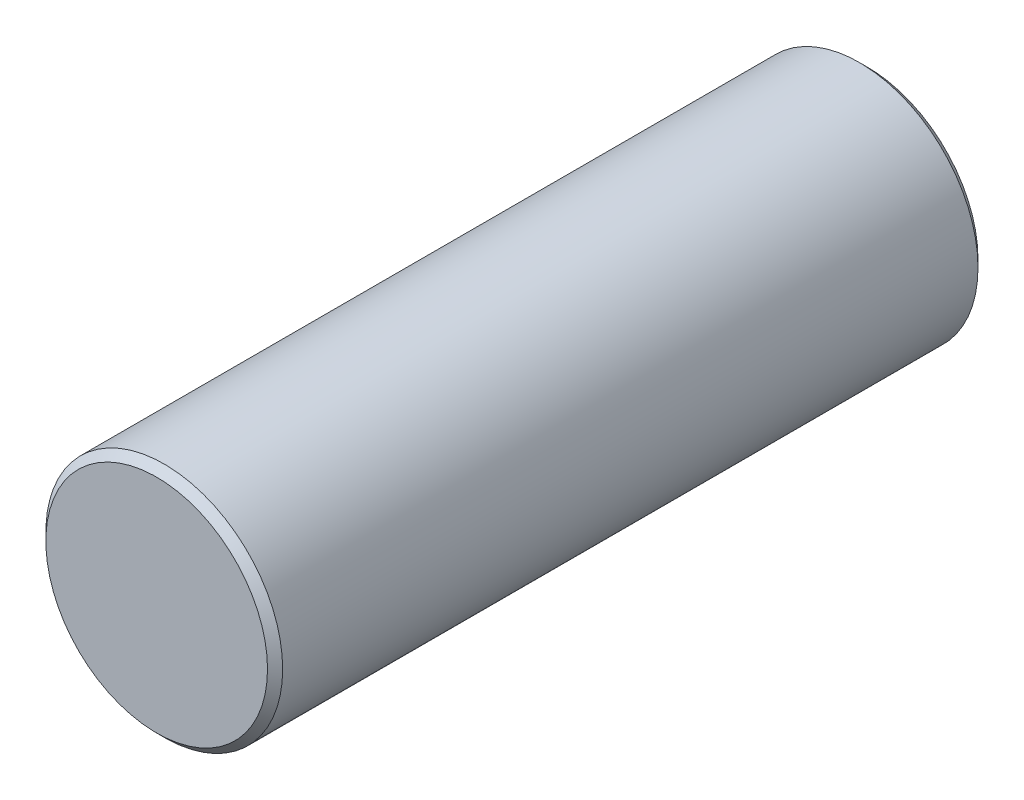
ISO-10303-21;
HEADER;
FILE_DESCRIPTION(('STEP AP214'),'2;1');
FILE_NAME('part.step','',(''),(''),'','','');
FILE_SCHEMA(('AUTOMOTIVE_DESIGN { 1 0 10303 214 1 1 1 1 }'));
ENDSEC;
DATA;
#1=APPLICATION_CONTEXT('core data for automotive mechanical design processes');
#2=APPLICATION_PROTOCOL_DEFINITION('international standard','automotive_design',2000,#1);
#3=PRODUCT_CONTEXT('',#1,'mechanical');
#4=PRODUCT('Part','Part','',(#3));
#5=PRODUCT_RELATED_PRODUCT_CATEGORY('part','',(#4));
#6=PRODUCT_DEFINITION_FORMATION('','',#4);
#7=PRODUCT_DEFINITION_CONTEXT('part definition',#1,'design');
#8=PRODUCT_DEFINITION('design','',#6,#7);
#9=PRODUCT_DEFINITION_SHAPE('','',#8);
#10=(LENGTH_UNIT() NAMED_UNIT(*) SI_UNIT(.MILLI.,.METRE.));
#11=(NAMED_UNIT(*) PLANE_ANGLE_UNIT() SI_UNIT($,.RADIAN.));
#12=(NAMED_UNIT(*) SI_UNIT($,.STERADIAN.) SOLID_ANGLE_UNIT());
#13=UNCERTAINTY_MEASURE_WITH_UNIT(LENGTH_MEASURE(1.E-05),#10,'distance_accuracy_value','');
#14=(GEOMETRIC_REPRESENTATION_CONTEXT(3) GLOBAL_UNCERTAINTY_ASSIGNED_CONTEXT((#13)) GLOBAL_UNIT_ASSIGNED_CONTEXT((#10,
#11,#12)) REPRESENTATION_CONTEXT('',''));
#15=CARTESIAN_POINT('',(0.,0.,0.));
#16=DIRECTION('',(0.,0.,1.));
#17=DIRECTION('',(1.,0.,0.));
#18=AXIS2_PLACEMENT_3D('',#15,#16,#17);
#19=CARTESIAN_POINT('',(0.,0.,19.05));
#20=DIRECTION('',(0.,0.,-1.));
#21=DIRECTION('',(-1.,0.,0.));
#22=AXIS2_PLACEMENT_3D('',#19,#20,#21);
#23=CYLINDRICAL_SURFACE('',#22,6.35);
#24=CARTESIAN_POINT('',(0.,0.,-18.6436));
#25=DIRECTION('',(0.,0.,1.));
#26=DIRECTION('',(1.,0.,0.));
#27=AXIS2_PLACEMENT_3D('',#24,#25,#26);
#28=CIRCLE('',#27,6.35);
#29=CARTESIAN_POINT('',(6.35,0.,-18.6436));
#30=VERTEX_POINT('',#29);
#31=EDGE_CURVE('E81',#30,#30,#28,.T.);
#32=ORIENTED_EDGE('',*,*,#31,.T.);
#33=EDGE_LOOP('',(#32));
#34=FACE_BOUND('',#33,.T.);
#35=CARTESIAN_POINT('',(0.,0.,18.6436));
#36=DIRECTION('',(0.,0.,1.));
#37=DIRECTION('',(1.,0.,0.));
#38=AXIS2_PLACEMENT_3D('',#35,#36,#37);
#39=CIRCLE('',#38,6.35);
#40=CARTESIAN_POINT('',(6.35,0.,18.6436));
#41=VERTEX_POINT('',#40);
#42=EDGE_CURVE('E85',#41,#41,#39,.F.);
#43=ORIENTED_EDGE('',*,*,#42,.T.);
#44=EDGE_LOOP('',(#43));
#45=FACE_BOUND('',#44,.T.);
#46=CARTESIAN_POINT('',(0.,-6.35,10.715625));
#47=CARTESIAN_POINT('',(0.108647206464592,-6.34999945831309,10.7156257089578));
#48=CARTESIAN_POINT('',(0.217301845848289,-6.34718528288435,10.7245772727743));
#49=CARTESIAN_POINT('',(0.431433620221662,-6.3362346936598,10.7600531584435));
#50=CARTESIAN_POINT('',(0.536910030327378,-6.32809707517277,10.7865814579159));
#51=CARTESIAN_POINT('',(0.741566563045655,-6.30738857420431,10.8562288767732));
#52=CARTESIAN_POINT('',(0.840756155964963,-6.29482455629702,10.8993223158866));
#53=CARTESIAN_POINT('',(1.030501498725,-6.26656051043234,11.0007674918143));
#54=CARTESIAN_POINT('',(1.12105588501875,-6.25085998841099,11.0591216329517));
#55=CARTESIAN_POINT('',(1.29375746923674,-6.21744714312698,11.1913288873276));
#56=CARTESIAN_POINT('',(1.3756005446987,-6.19969099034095,11.2655681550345));
#57=CARTESIAN_POINT('',(1.52590084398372,-6.16442198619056,11.4266160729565));
#58=CARTESIAN_POINT('',(1.59435557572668,-6.14690918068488,11.5134270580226));
#59=CARTESIAN_POINT('',(1.71758509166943,-6.11363942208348,11.6997869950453));
#60=CARTESIAN_POINT('',(1.77197994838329,-6.09793656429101,11.7995977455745));
#61=CARTESIAN_POINT('',(1.86308588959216,-6.07072385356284,12.0075203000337));
#62=CARTESIAN_POINT('',(1.89980163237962,-6.05921289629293,12.1156299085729));
#63=CARTESIAN_POINT('',(1.95339430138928,-6.04214576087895,12.3336495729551));
#64=CARTESIAN_POINT('',(1.97083537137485,-6.03642069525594,12.4434073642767));
#65=CARTESIAN_POINT('',(1.98714606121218,-6.03107212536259,12.6644290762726));
#66=CARTESIAN_POINT('',(1.98602061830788,-6.03144699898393,12.7756925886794));
#67=CARTESIAN_POINT('',(1.96567146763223,-6.03810687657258,12.991900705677));
#68=CARTESIAN_POINT('',(1.94716491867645,-6.04415767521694,13.0969212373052));
#69=CARTESIAN_POINT('',(1.89374166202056,-6.06110715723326,13.302285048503));
#70=CARTESIAN_POINT('',(1.85882321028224,-6.07200635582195,13.4026278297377));
#71=CARTESIAN_POINT('',(1.77306088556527,-6.09760407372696,13.5974962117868));
#72=CARTESIAN_POINT('',(1.72199181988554,-6.11235576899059,13.6919154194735));
#73=CARTESIAN_POINT('',(1.60553432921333,-6.14397197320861,13.8710793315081));
#74=CARTESIAN_POINT('',(1.54014218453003,-6.1608370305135,13.9558215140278));
#75=CARTESIAN_POINT('',(1.39337566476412,-6.19571925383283,14.1172802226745));
#76=CARTESIAN_POINT('',(1.31140925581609,-6.21375391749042,14.1934557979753));
#77=CARTESIAN_POINT('',(1.13564099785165,-6.24826618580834,14.3311116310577));
#78=CARTESIAN_POINT('',(1.04183827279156,-6.26474367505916,14.3925908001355));
#79=CARTESIAN_POINT('',(0.844017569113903,-6.29445805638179,14.4994752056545));
#80=CARTESIAN_POINT('',(0.73992566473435,-6.3076686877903,14.5447514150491));
#81=CARTESIAN_POINT('',(0.525094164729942,-6.32917129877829,14.6169903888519));
#82=CARTESIAN_POINT('',(0.41435659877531,-6.33746477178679,14.6439587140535));
#83=CARTESIAN_POINT('',(0.193968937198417,-6.34795830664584,14.6778948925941));
#84=CARTESIAN_POINT('',(0.0844420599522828,-6.35038136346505,14.6855950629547));
#85=CARTESIAN_POINT('',(-0.134350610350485,-6.34952057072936,14.6828411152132));
#86=CARTESIAN_POINT('',(-0.243616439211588,-6.34623755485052,14.6723896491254));
#87=CARTESIAN_POINT('',(-0.455960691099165,-6.33448002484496,14.6342169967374));
#88=CARTESIAN_POINT('',(-0.559125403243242,-6.32613659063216,14.6069315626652));
#89=CARTESIAN_POINT('',(-0.759383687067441,-6.30523442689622,14.5363972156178));
#90=CARTESIAN_POINT('',(-0.856476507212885,-6.29267517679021,14.4931463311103));
#91=CARTESIAN_POINT('',(-1.0444676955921,-6.26425186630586,14.390730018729));
#92=CARTESIAN_POINT('',(-1.13515733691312,-6.24831470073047,14.3312023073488));
#93=CARTESIAN_POINT('',(-1.30550578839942,-6.21495788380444,14.1983567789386));
#94=CARTESIAN_POINT('',(-1.38516159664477,-6.19753783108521,14.1250352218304));
#95=CARTESIAN_POINT('',(-1.53445759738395,-6.16230979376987,13.9632390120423));
#96=CARTESIAN_POINT('',(-1.60357585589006,-6.14451378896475,13.874279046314));
#97=CARTESIAN_POINT('',(-1.72594984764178,-6.11127091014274,13.6856364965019));
#98=CARTESIAN_POINT('',(-1.7792058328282,-6.09582399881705,13.5859540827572));
#99=CARTESIAN_POINT('',(-1.86801257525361,-6.06919954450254,13.3789020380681));
#100=CARTESIAN_POINT('',(-1.9036318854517,-6.05800551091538,13.2715640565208));
#101=CARTESIAN_POINT('',(-1.95616344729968,-6.04124983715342,13.0519924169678));
#102=CARTESIAN_POINT('',(-1.97308281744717,-6.03568605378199,12.9397606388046));
#103=CARTESIAN_POINT('',(-1.98722307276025,-6.03104414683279,12.7190435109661));
#104=CARTESIAN_POINT('',(-1.98530018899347,-6.03168409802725,12.6106182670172));
#105=CARTESIAN_POINT('',(-1.96387748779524,-6.03869268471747,12.3957165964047));
#106=CARTESIAN_POINT('',(-1.94437849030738,-6.04506105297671,12.2892400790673));
#107=CARTESIAN_POINT('',(-1.88893021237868,-6.06261192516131,12.0827894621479));
#108=CARTESIAN_POINT('',(-1.85322594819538,-6.07372258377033,11.9827429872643));
#109=CARTESIAN_POINT('',(-1.76657360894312,-6.0994878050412,11.7899808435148));
#110=CARTESIAN_POINT('',(-1.71562243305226,-6.11414308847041,11.6972666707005));
#111=CARTESIAN_POINT('',(-1.59759134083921,-6.14606160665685,11.5178745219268));
#112=CARTESIAN_POINT('',(-1.5299584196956,-6.16340443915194,11.4315745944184));
#113=CARTESIAN_POINT('',(-1.38145678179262,-6.19837785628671,11.2712717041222));
#114=CARTESIAN_POINT('',(-1.30058452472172,-6.21600851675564,11.1972720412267));
#115=CARTESIAN_POINT('',(-1.12472257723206,-6.25026169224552,11.0612514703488));
#116=CARTESIAN_POINT('',(-1.02935813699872,-6.26683248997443,10.9997006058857));
#117=CARTESIAN_POINT('',(-0.829118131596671,-6.29644996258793,10.8935854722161));
#118=CARTESIAN_POINT('',(-0.724246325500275,-6.30949802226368,10.8490145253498));
#119=CARTESIAN_POINT('',(-0.517124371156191,-6.32969033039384,10.7813612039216));
#120=CARTESIAN_POINT('',(-0.415401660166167,-6.3372403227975,10.7567811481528));
#121=CARTESIAN_POINT('',(-0.209121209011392,-6.34739491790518,10.7239143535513));
#122=CARTESIAN_POINT('',(-0.104564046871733,-6.35000052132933,10.7156243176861));
#123=CARTESIAN_POINT('',(0.,-6.35,10.715625));
#124=B_SPLINE_CURVE_WITH_KNOTS('',3,(#46,#47,#48,#49,#50,#51,#52,#53,#54,#55,#56,#57,#58,#59,
#60,#61,#62,#63,#64,#65,#66,#67,#68,#69,#70,#71,#72,#73,#74,#75,#76,#77,#78,#79,#80,#81,#82,#83,
#84,#85,#86,#87,#88,#89,#90,#91,#92,#93,#94,#95,#96,#97,#98,#99,#100,#101,#102,#103,#104,#105,
#106,#107,#108,#109,#110,#111,#112,#113,#114,#115,#116,#117,#118,#119,#120,#121,#122,#123),
.UNSPECIFIED.,.T.,.F.,(4,2,2,2,2,2,2,2,2,2,2,2,2,2,2,2,2,2,2,2,2,2,2,2,2,2,2,2,2,2,2,2,2,2,2,2,
2,2,4),(0.,0.325557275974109,0.651188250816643,0.976316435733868,1.30149587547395,
1.63572542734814,1.97001713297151,2.31257111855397,2.65503479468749,2.98718525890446,
3.31924739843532,3.63818356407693,3.95715362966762,4.28078332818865,4.60449717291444,
4.94294711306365,5.28142211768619,5.6225354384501,5.96354510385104,6.29138265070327,
6.61917230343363,6.93881369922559,7.25849457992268,7.5859691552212,7.91353265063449,
8.2540757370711,8.59461341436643,8.93381683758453,9.27289109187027,9.59663123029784,
9.92035626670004,10.2393418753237,10.5583924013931,10.8899247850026,11.2215459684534,
11.5639956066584,11.9063104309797,12.2196961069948,12.533018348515),.UNSPECIFIED.);
#125=CARTESIAN_POINT('',(0.,-6.35,10.715625));
#126=VERTEX_POINT('',#125);
#127=EDGE_CURVE('E35',#126,#126,#124,.T.);
#128=ORIENTED_EDGE('',*,*,#127,.F.);
#129=EDGE_LOOP('',(#128));
#130=FACE_BOUND('',#129,.T.);
#131=CARTESIAN_POINT('',(0.,-6.35,-14.684375));
#132=CARTESIAN_POINT('',(0.108647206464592,-6.34999945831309,-14.6843742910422));
#133=CARTESIAN_POINT('',(0.217301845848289,-6.34718528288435,-14.6754227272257));
#134=CARTESIAN_POINT('',(0.431433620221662,-6.3362346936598,-14.6399468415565));
#135=CARTESIAN_POINT('',(0.536910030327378,-6.32809707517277,-14.6134185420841));
#136=CARTESIAN_POINT('',(0.741566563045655,-6.30738857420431,-14.5437711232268));
#137=CARTESIAN_POINT('',(0.840756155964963,-6.29482455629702,-14.5006776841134));
#138=CARTESIAN_POINT('',(1.030501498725,-6.26656051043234,-14.3992325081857));
#139=CARTESIAN_POINT('',(1.12105588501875,-6.25085998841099,-14.3408783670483));
#140=CARTESIAN_POINT('',(1.29375746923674,-6.21744714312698,-14.2086711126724));
#141=CARTESIAN_POINT('',(1.3756005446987,-6.19969099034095,-14.1344318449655));
#142=CARTESIAN_POINT('',(1.52590084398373,-6.16442198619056,-13.9733839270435));
#143=CARTESIAN_POINT('',(1.59435557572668,-6.14690918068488,-13.8865729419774));
#144=CARTESIAN_POINT('',(1.71758509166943,-6.11363942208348,-13.7002130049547));
#145=CARTESIAN_POINT('',(1.77197994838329,-6.09793656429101,-13.6004022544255));
#146=CARTESIAN_POINT('',(1.86308588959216,-6.07072385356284,-13.3924796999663));
#147=CARTESIAN_POINT('',(1.89980163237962,-6.05921289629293,-13.2843700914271));
#148=CARTESIAN_POINT('',(1.95339430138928,-6.04214576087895,-13.0663504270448));
#149=CARTESIAN_POINT('',(1.97083537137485,-6.03642069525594,-12.9565926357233));
#150=CARTESIAN_POINT('',(1.98714606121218,-6.03107212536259,-12.7355709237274));
#151=CARTESIAN_POINT('',(1.98602061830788,-6.03144699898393,-12.6243074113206));
#152=CARTESIAN_POINT('',(1.96567146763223,-6.03810687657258,-12.408099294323));
#153=CARTESIAN_POINT('',(1.94716491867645,-6.04415767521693,-12.3030787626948));
#154=CARTESIAN_POINT('',(1.89374166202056,-6.06110715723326,-12.097714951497));
#155=CARTESIAN_POINT('',(1.85882321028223,-6.07200635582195,-11.9973721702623));
#156=CARTESIAN_POINT('',(1.77306088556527,-6.09760407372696,-11.8025037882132));
#157=CARTESIAN_POINT('',(1.72199181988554,-6.11235576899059,-11.7080845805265));
#158=CARTESIAN_POINT('',(1.60553432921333,-6.14397197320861,-11.5289206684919));
#159=CARTESIAN_POINT('',(1.54014218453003,-6.1608370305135,-11.4441784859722));
#160=CARTESIAN_POINT('',(1.39337566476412,-6.19571925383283,-11.2827197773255));
#161=CARTESIAN_POINT('',(1.31140925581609,-6.21375391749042,-11.2065442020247));
#162=CARTESIAN_POINT('',(1.13564099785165,-6.24826618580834,-11.0688883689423));
#163=CARTESIAN_POINT('',(1.04183827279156,-6.26474367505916,-11.0074091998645));
#164=CARTESIAN_POINT('',(0.844017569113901,-6.29445805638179,-10.9005247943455));
#165=CARTESIAN_POINT('',(0.739925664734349,-6.3076686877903,-10.8552485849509));
#166=CARTESIAN_POINT('',(0.525094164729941,-6.3291712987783,-10.7830096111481));
#167=CARTESIAN_POINT('',(0.414356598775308,-6.33746477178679,-10.7560412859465));
#168=CARTESIAN_POINT('',(0.193968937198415,-6.34795830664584,-10.7221051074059));
#169=CARTESIAN_POINT('',(0.0844420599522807,-6.35038136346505,-10.7144049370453));
#170=CARTESIAN_POINT('',(-0.134350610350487,-6.34952057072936,-10.7171588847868));
#171=CARTESIAN_POINT('',(-0.24361643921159,-6.34623755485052,-10.7276103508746));
#172=CARTESIAN_POINT('',(-0.455960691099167,-6.33448002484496,-10.7657830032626));
#173=CARTESIAN_POINT('',(-0.559125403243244,-6.32613659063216,-10.7930684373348));
#174=CARTESIAN_POINT('',(-0.759383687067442,-6.30523442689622,-10.8636027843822));
#175=CARTESIAN_POINT('',(-0.856476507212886,-6.29267517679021,-10.9068536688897));
#176=CARTESIAN_POINT('',(-1.0444676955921,-6.26425186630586,-11.009269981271));
#177=CARTESIAN_POINT('',(-1.13515733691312,-6.24831470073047,-11.0687976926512));
#178=CARTESIAN_POINT('',(-1.30550578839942,-6.21495788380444,-11.2016432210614));
#179=CARTESIAN_POINT('',(-1.38516159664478,-6.19753783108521,-11.2749647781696));
#180=CARTESIAN_POINT('',(-1.53445759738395,-6.16230979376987,-11.4367609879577));
#181=CARTESIAN_POINT('',(-1.60357585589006,-6.14451378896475,-11.525720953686));
#182=CARTESIAN_POINT('',(-1.72594984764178,-6.11127091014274,-11.7143635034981));
#183=CARTESIAN_POINT('',(-1.7792058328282,-6.09582399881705,-11.8140459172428));
#184=CARTESIAN_POINT('',(-1.86801257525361,-6.06919954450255,-12.0210979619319));
#185=CARTESIAN_POINT('',(-1.9036318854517,-6.05800551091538,-12.1284359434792));
#186=CARTESIAN_POINT('',(-1.95616344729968,-6.04124983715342,-12.3480075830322));
#187=CARTESIAN_POINT('',(-1.97308281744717,-6.03568605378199,-12.4602393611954));
#188=CARTESIAN_POINT('',(-1.98722307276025,-6.03104414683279,-12.6809564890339));
#189=CARTESIAN_POINT('',(-1.98530018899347,-6.03168409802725,-12.7893817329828));
#190=CARTESIAN_POINT('',(-1.96387748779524,-6.03869268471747,-13.0042834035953));
#191=CARTESIAN_POINT('',(-1.94437849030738,-6.04506105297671,-13.1107599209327));
#192=CARTESIAN_POINT('',(-1.88893021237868,-6.06261192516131,-13.3172105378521));
#193=CARTESIAN_POINT('',(-1.85322594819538,-6.07372258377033,-13.4172570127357));
#194=CARTESIAN_POINT('',(-1.76657360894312,-6.0994878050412,-13.6100191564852));
#195=CARTESIAN_POINT('',(-1.71562243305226,-6.11414308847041,-13.7027333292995));
#196=CARTESIAN_POINT('',(-1.59759134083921,-6.14606160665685,-13.8821254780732));
#197=CARTESIAN_POINT('',(-1.5299584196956,-6.16340443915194,-13.9684254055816));
#198=CARTESIAN_POINT('',(-1.38145678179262,-6.19837785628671,-14.1287282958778));
#199=CARTESIAN_POINT('',(-1.30058452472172,-6.21600851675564,-14.2027279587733));
#200=CARTESIAN_POINT('',(-1.12472257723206,-6.25026169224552,-14.3387485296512));
#201=CARTESIAN_POINT('',(-1.02935813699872,-6.26683248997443,-14.4002993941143));
#202=CARTESIAN_POINT('',(-0.82911813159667,-6.29644996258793,-14.5064145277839));
#203=CARTESIAN_POINT('',(-0.724246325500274,-6.30949802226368,-14.5509854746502));
#204=CARTESIAN_POINT('',(-0.51712437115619,-6.32969033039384,-14.6186387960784));
#205=CARTESIAN_POINT('',(-0.415401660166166,-6.3372403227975,-14.6432188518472));
#206=CARTESIAN_POINT('',(-0.209121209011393,-6.34739491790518,-14.6760856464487));
#207=CARTESIAN_POINT('',(-0.104564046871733,-6.35000052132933,-14.6843756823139));
#208=CARTESIAN_POINT('',(0.,-6.35,-14.684375));
#209=B_SPLINE_CURVE_WITH_KNOTS('',3,(#131,#132,#133,#134,#135,#136,#137,#138,#139,#140,#141,
#142,#143,#144,#145,#146,#147,#148,#149,#150,#151,#152,#153,#154,#155,#156,#157,#158,#159,#160,
#161,#162,#163,#164,#165,#166,#167,#168,#169,#170,#171,#172,#173,#174,#175,#176,#177,#178,#179,
#180,#181,#182,#183,#184,#185,#186,#187,#188,#189,#190,#191,#192,#193,#194,#195,#196,#197,#198,
#199,#200,#201,#202,#203,#204,#205,#206,#207,#208),.UNSPECIFIED.,.T.,.F.,(4,2,2,2,2,2,2,2,2,2,2,
2,2,2,2,2,2,2,2,2,2,2,2,2,2,2,2,2,2,2,2,2,2,2,2,2,2,2,4),(0.,0.325557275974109,
0.651188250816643,0.976316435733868,1.30149587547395,1.63572542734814,1.97001713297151,
2.31257111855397,2.65503479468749,2.98718525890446,3.31924739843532,3.63818356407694,
3.95715362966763,4.28078332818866,4.60449717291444,4.94294711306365,5.28142211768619,
5.6225354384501,5.96354510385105,6.29138265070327,6.61917230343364,6.9388136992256,
7.25849457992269,7.5859691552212,7.91353265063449,8.2540757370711,8.59461341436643,
8.93381683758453,9.27289109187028,9.59663123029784,9.92035626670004,10.2393418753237,
10.5583924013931,10.8899247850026,11.2215459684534,11.5639956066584,11.9063104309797,
12.2196961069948,12.533018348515),.UNSPECIFIED.);
#210=CARTESIAN_POINT('',(0.,-6.35,-14.684375));
#211=VERTEX_POINT('',#210);
#212=EDGE_CURVE('E10',#211,#211,#209,.T.);
#213=ORIENTED_EDGE('',*,*,#212,.F.);
#214=EDGE_LOOP('',(#213));
#215=FACE_BOUND('',#214,.T.);
#216=ADVANCED_FACE('F25',(#34,#45,#130,#215),#23,.T.);
#217=CARTESIAN_POINT('',(0.,0.,19.05));
#218=DIRECTION('',(0.,0.,1.));
#219=DIRECTION('',(1.,0.,0.));
#220=AXIS2_PLACEMENT_3D('',#217,#218,#219);
#221=PLANE('',#220);
#222=CARTESIAN_POINT('',(0.,0.,19.05));
#223=DIRECTION('',(0.,0.,1.));
#224=DIRECTION('',(1.,0.,0.));
#225=AXIS2_PLACEMENT_3D('',#222,#223,#224);
#226=CIRCLE('',#225,5.94360000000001);
#227=CARTESIAN_POINT('',(5.94360000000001,0.,19.05));
#228=VERTEX_POINT('',#227);
#229=EDGE_CURVE('E39',#228,#228,#226,.T.);
#230=ORIENTED_EDGE('',*,*,#229,.T.);
#231=EDGE_LOOP('',(#230));
#232=FACE_BOUND('',#231,.T.);
#233=ADVANCED_FACE('F66',(#232),#221,.T.);
#234=CARTESIAN_POINT('',(0.,0.,-19.05));
#235=DIRECTION('',(0.,0.,1.));
#236=DIRECTION('',(1.,0.,0.));
#237=AXIS2_PLACEMENT_3D('',#234,#235,#236);
#238=PLANE('',#237);
#239=CARTESIAN_POINT('',(0.,0.,-19.05));
#240=DIRECTION('',(0.,0.,1.));
#241=DIRECTION('',(1.,0.,0.));
#242=AXIS2_PLACEMENT_3D('',#239,#240,#241);
#243=CIRCLE('',#242,5.94359999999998);
#244=CARTESIAN_POINT('',(5.94359999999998,0.,-19.05));
#245=VERTEX_POINT('',#244);
#246=EDGE_CURVE('E43',#245,#245,#243,.F.);
#247=ORIENTED_EDGE('',*,*,#246,.T.);
#248=EDGE_LOOP('',(#247));
#249=FACE_BOUND('',#248,.T.);
#250=ADVANCED_FACE('F63',(#249),#238,.F.);
#251=CARTESIAN_POINT('',(0.,0.,-18.6436));
#252=DIRECTION('',(0.,0.,1.));
#253=DIRECTION('',(1.,0.,0.));
#254=AXIS2_PLACEMENT_3D('',#251,#252,#253);
#255=CONICAL_SURFACE('',#254,6.35,0.785398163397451);
#256=ORIENTED_EDGE('',*,*,#246,.F.);
#257=EDGE_LOOP('',(#256));
#258=FACE_BOUND('',#257,.T.);
#259=ORIENTED_EDGE('',*,*,#31,.F.);
#260=EDGE_LOOP('',(#259));
#261=FACE_BOUND('',#260,.T.);
#262=ADVANCED_FACE('F59',(#258,#261),#255,.T.);
#263=CARTESIAN_POINT('',(0.,0.,19.05));
#264=DIRECTION('',(0.,0.,-1.));
#265=DIRECTION('',(-1.,0.,0.));
#266=AXIS2_PLACEMENT_3D('',#263,#264,#265);
#267=CONICAL_SURFACE('',#266,5.94360000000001,0.785398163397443);
#268=ORIENTED_EDGE('',*,*,#42,.F.);
#269=EDGE_LOOP('',(#268));
#270=FACE_BOUND('',#269,.T.);
#271=ORIENTED_EDGE('',*,*,#229,.F.);
#272=EDGE_LOOP('',(#271));
#273=FACE_BOUND('',#272,.T.);
#274=ADVANCED_FACE('F55',(#270,#273),#267,.T.);
#275=CARTESIAN_POINT('',(0.,0.,12.7));
#276=DIRECTION('',(0.,-1.,0.));
#277=DIRECTION('',(0.,0.,-1.));
#278=AXIS2_PLACEMENT_3D('',#275,#276,#277);
#279=CYLINDRICAL_SURFACE('',#278,1.984375);
#280=CARTESIAN_POINT('',(0.,0.,12.7));
#281=DIRECTION('',(0.,1.,0.));
#282=DIRECTION('',(0.,0.,1.));
#283=AXIS2_PLACEMENT_3D('',#280,#281,#282);
#284=CIRCLE('',#283,1.984375);
#285=CARTESIAN_POINT('',(0.,0.,14.684375));
#286=VERTEX_POINT('',#285);
#287=EDGE_CURVE('E87',#286,#286,#284,.T.);
#288=ORIENTED_EDGE('',*,*,#287,.T.);
#289=EDGE_LOOP('',(#288));
#290=FACE_BOUND('',#289,.T.);
#291=ORIENTED_EDGE('',*,*,#127,.T.);
#292=EDGE_LOOP('',(#291));
#293=FACE_BOUND('',#292,.T.);
#294=ADVANCED_FACE('F49',(#290,#293),#279,.F.);
#295=CARTESIAN_POINT('',(0.,0.,12.7));
#296=DIRECTION('',(0.,1.,0.));
#297=DIRECTION('',(0.,0.,1.));
#298=AXIS2_PLACEMENT_3D('',#295,#296,#297);
#299=PLANE('',#298);
#300=ORIENTED_EDGE('',*,*,#287,.F.);
#301=EDGE_LOOP('',(#300));
#302=FACE_BOUND('',#301,.T.);
#303=ADVANCED_FACE('F54',(#302),#299,.F.);
#304=CARTESIAN_POINT('',(0.,0.,-12.7));
#305=DIRECTION('',(0.,-1.,0.));
#306=DIRECTION('',(0.,0.,-1.));
#307=AXIS2_PLACEMENT_3D('',#304,#305,#306);
#308=CYLINDRICAL_SURFACE('',#307,1.984375);
#309=CARTESIAN_POINT('',(0.,0.,-12.7));
#310=DIRECTION('',(0.,1.,0.));
#311=DIRECTION('',(0.,0.,1.));
#312=AXIS2_PLACEMENT_3D('',#309,#310,#311);
#313=CIRCLE('',#312,1.984375);
#314=CARTESIAN_POINT('',(0.,0.,-10.715625));
#315=VERTEX_POINT('',#314);
#316=EDGE_CURVE('E91',#315,#315,#313,.T.);
#317=ORIENTED_EDGE('',*,*,#316,.T.);
#318=EDGE_LOOP('',(#317));
#319=FACE_BOUND('',#318,.T.);
#320=ORIENTED_EDGE('',*,*,#212,.T.);
#321=EDGE_LOOP('',(#320));
#322=FACE_BOUND('',#321,.T.);
#323=ADVANCED_FACE('F100',(#319,#322),#308,.F.);
#324=CARTESIAN_POINT('',(0.,0.,-12.7));
#325=DIRECTION('',(0.,1.,0.));
#326=DIRECTION('',(0.,0.,1.));
#327=AXIS2_PLACEMENT_3D('',#324,#325,#326);
#328=PLANE('',#327);
#329=ORIENTED_EDGE('',*,*,#316,.F.);
#330=EDGE_LOOP('',(#329));
#331=FACE_BOUND('',#330,.T.);
#332=ADVANCED_FACE('F102',(#331),#328,.F.);
#333=CLOSED_SHELL('',(#216,#233,#250,#262,#274,#294,#303,#323,#332));
#334=MANIFOLD_SOLID_BREP('B2',#333);
#335=ADVANCED_BREP_SHAPE_REPRESENTATION('',(#18,#334),#14);
#336=SHAPE_DEFINITION_REPRESENTATION(#9,#335);
ENDSEC;
END-ISO-10303-21;
